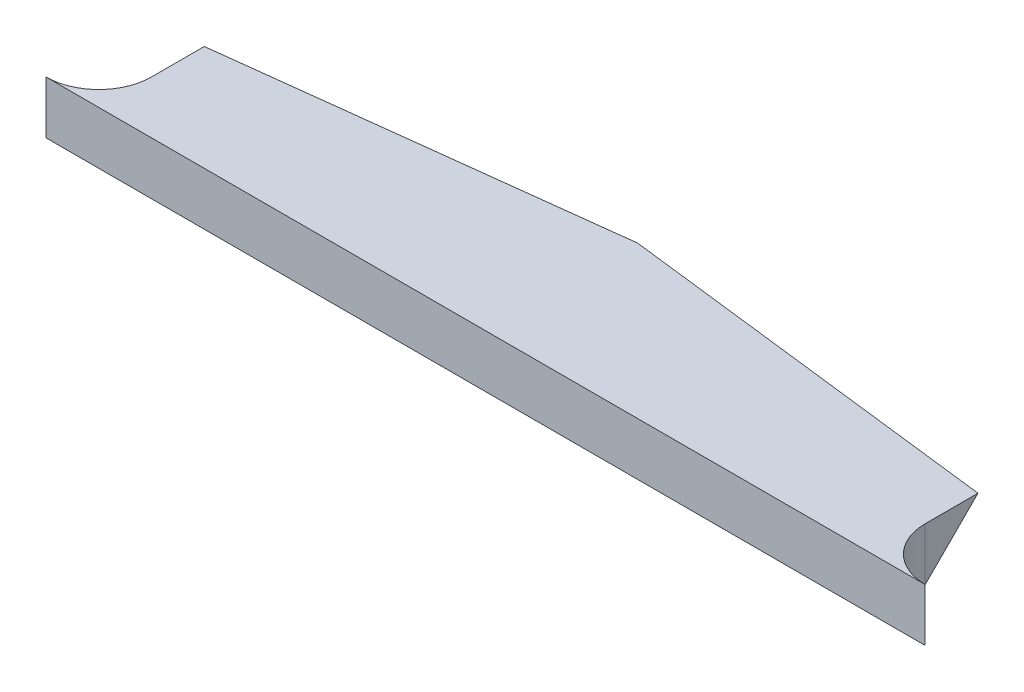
ISO-10303-21;
HEADER;
FILE_DESCRIPTION(('STEP AP214'),'2;1');
FILE_NAME('part.step','',(''),(''),'','','');
FILE_SCHEMA(('AUTOMOTIVE_DESIGN { 1 0 10303 214 1 1 1 1 }'));
ENDSEC;
DATA;
#1=APPLICATION_CONTEXT('core data for automotive mechanical design processes');
#2=APPLICATION_PROTOCOL_DEFINITION('international standard','automotive_design',2000,#1);
#3=PRODUCT_CONTEXT('',#1,'mechanical');
#4=PRODUCT('Part','Part','',(#3));
#5=PRODUCT_RELATED_PRODUCT_CATEGORY('part','',(#4));
#6=PRODUCT_DEFINITION_FORMATION('','',#4);
#7=PRODUCT_DEFINITION_CONTEXT('part definition',#1,'design');
#8=PRODUCT_DEFINITION('design','',#6,#7);
#9=PRODUCT_DEFINITION_SHAPE('','',#8);
#10=(LENGTH_UNIT() NAMED_UNIT(*) SI_UNIT(.MILLI.,.METRE.));
#11=(NAMED_UNIT(*) PLANE_ANGLE_UNIT() SI_UNIT($,.RADIAN.));
#12=(NAMED_UNIT(*) SI_UNIT($,.STERADIAN.) SOLID_ANGLE_UNIT());
#13=UNCERTAINTY_MEASURE_WITH_UNIT(LENGTH_MEASURE(1.E-05),#10,'distance_accuracy_value','');
#14=(GEOMETRIC_REPRESENTATION_CONTEXT(3) GLOBAL_UNCERTAINTY_ASSIGNED_CONTEXT((#13)) GLOBAL_UNIT_ASSIGNED_CONTEXT((#10,
#11,#12)) REPRESENTATION_CONTEXT('',''));
#15=CARTESIAN_POINT('',(0.,0.,0.));
#16=DIRECTION('',(0.,0.,1.));
#17=DIRECTION('',(1.,0.,0.));
#18=AXIS2_PLACEMENT_3D('',#15,#16,#17);
#19=CARTESIAN_POINT('',(50.0000000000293,19256.6480911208,193807.287108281));
#20=DIRECTION('',(0.,1.,0.));
#21=DIRECTION('',(0.,0.,1.));
#22=AXIS2_PLACEMENT_3D('',#19,#20,#21);
#23=PLANE('',#22);
#24=DIRECTION('',(0.,0.,-1.));
#25=VECTOR('',#24,1.);
#26=CARTESIAN_POINT('',(-43.9999999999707,19256.6480911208,193801.287108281));
#27=LINE('',#26,#25);
#28=CARTESIAN_POINT('',(-43.9999999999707,19256.6480911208,193801.287108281));
#29=VERTEX_POINT('',#28);
#30=CARTESIAN_POINT('',(-43.9999999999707,19256.6480911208,193795.287108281));
#31=VERTEX_POINT('',#30);
#32=EDGE_CURVE('E123',#29,#31,#27,.T.);
#33=ORIENTED_EDGE('',*,*,#32,.F.);
#34=CARTESIAN_POINT('',(-49.9999999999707,19256.6480911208,193801.287108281));
#35=DIRECTION('',(0.,1.,0.));
#36=DIRECTION('',(0.,0.,1.));
#37=AXIS2_PLACEMENT_3D('',#34,#35,#36);
#38=CIRCLE('',#37,6.);
#39=CARTESIAN_POINT('',(-49.9999999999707,19256.6480911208,193807.287108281));
#40=VERTEX_POINT('',#39);
#41=EDGE_CURVE('E148',#40,#29,#38,.T.);
#42=ORIENTED_EDGE('',*,*,#41,.F.);
#43=DIRECTION('',(1.,0.,0.));
#44=VECTOR('',#43,1.);
#45=CARTESIAN_POINT('',(50.0000000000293,19256.6480911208,193807.287108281));
#46=LINE('',#45,#44);
#47=CARTESIAN_POINT('',(50.0000000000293,19256.6480911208,193807.287108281));
#48=VERTEX_POINT('',#47);
#49=EDGE_CURVE('E11',#40,#48,#46,.T.);
#50=ORIENTED_EDGE('',*,*,#49,.T.);
#51=CARTESIAN_POINT('',(50.0000000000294,19256.6480911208,193801.287108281));
#52=DIRECTION('',(0.,1.,0.));
#53=DIRECTION('',(0.,0.,1.));
#54=AXIS2_PLACEMENT_3D('',#51,#52,#53);
#55=CIRCLE('',#54,6.);
#56=CARTESIAN_POINT('',(44.0000000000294,19256.6480911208,193801.287108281));
#57=VERTEX_POINT('',#56);
#58=EDGE_CURVE('E59',#57,#48,#55,.T.);
#59=ORIENTED_EDGE('',*,*,#58,.F.);
#60=DIRECTION('',(0.,0.,1.));
#61=VECTOR('',#60,1.);
#62=CARTESIAN_POINT('',(44.0000000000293,19256.6480911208,193795.287108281));
#63=LINE('',#62,#61);
#64=CARTESIAN_POINT('',(44.0000000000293,19256.6480911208,193795.287108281));
#65=VERTEX_POINT('',#64);
#66=EDGE_CURVE('E121',#65,#57,#63,.T.);
#67=ORIENTED_EDGE('',*,*,#66,.F.);
#68=DIRECTION('',(-0.992876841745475,0.,-0.119145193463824));
#69=VECTOR('',#68,1.);
#70=CARTESIAN_POINT('',(44.0000000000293,19256.6480911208,193795.287108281));
#71=LINE('',#70,#69);
#72=CARTESIAN_POINT('',(2.93572725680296E-11,19256.6480911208,193790.007109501));
#73=VERTEX_POINT('',#72);
#74=EDGE_CURVE('E100',#65,#73,#71,.T.);
#75=ORIENTED_EDGE('',*,*,#74,.T.);
#76=DIRECTION('',(-0.992876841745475,0.,0.119145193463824));
#77=VECTOR('',#76,1.);
#78=CARTESIAN_POINT('',(2.93580080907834E-11,19256.6480911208,193790.007109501));
#79=LINE('',#78,#77);
#80=EDGE_CURVE('E111',#73,#31,#79,.T.);
#81=ORIENTED_EDGE('',*,*,#80,.T.);
#82=EDGE_LOOP('',(#33,#42,#50,#59,#67,#75,#81));
#83=FACE_BOUND('',#82,.T.);
#84=ADVANCED_FACE('F44',(#83),#23,.T.);
#85=CARTESIAN_POINT('',(50.0000000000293,19250.6480911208,193807.287108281));
#86=DIRECTION('',(0.,-1.,0.));
#87=DIRECTION('',(0.,0.,-1.));
#88=AXIS2_PLACEMENT_3D('',#85,#86,#87);
#89=PLANE('',#88);
#90=DIRECTION('',(0.992876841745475,0.,-0.119145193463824));
#91=VECTOR('',#90,1.);
#92=CARTESIAN_POINT('',(-43.9999999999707,19250.6480911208,193801.287108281));
#93=LINE('',#92,#91);
#94=CARTESIAN_POINT('',(-43.9999999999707,19250.6480911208,193801.287108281));
#95=VERTEX_POINT('',#94);
#96=CARTESIAN_POINT('',(2.93572707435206E-11,19250.6480911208,193796.007109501));
#97=VERTEX_POINT('',#96);
#98=EDGE_CURVE('E108',#95,#97,#93,.T.);
#99=ORIENTED_EDGE('',*,*,#98,.T.);
#100=DIRECTION('',(0.992876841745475,0.,0.119145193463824));
#101=VECTOR('',#100,1.);
#102=CARTESIAN_POINT('',(2.93572725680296E-11,19250.6480911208,193796.007109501));
#103=LINE('',#102,#101);
#104=CARTESIAN_POINT('',(44.0000000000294,19250.6480911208,193801.287108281));
#105=VERTEX_POINT('',#104);
#106=EDGE_CURVE('E103',#97,#105,#103,.T.);
#107=ORIENTED_EDGE('',*,*,#106,.T.);
#108=CARTESIAN_POINT('',(50.0000000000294,19250.6480911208,193801.287108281));
#109=DIRECTION('',(0.,-1.,0.));
#110=DIRECTION('',(0.,0.,-1.));
#111=AXIS2_PLACEMENT_3D('',#108,#109,#110);
#112=CIRCLE('',#111,6.);
#113=CARTESIAN_POINT('',(50.0000000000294,19250.6480911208,193807.287108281));
#114=VERTEX_POINT('',#113);
#115=EDGE_CURVE('E143',#114,#105,#112,.T.);
#116=ORIENTED_EDGE('',*,*,#115,.F.);
#117=DIRECTION('',(-1.,0.,0.));
#118=VECTOR('',#117,1.);
#119=CARTESIAN_POINT('',(50.0000000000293,19250.6480911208,193807.287108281));
#120=LINE('',#119,#118);
#121=CARTESIAN_POINT('',(-49.9999999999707,19250.6480911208,193807.287108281));
#122=VERTEX_POINT('',#121);
#123=EDGE_CURVE('E152',#114,#122,#120,.T.);
#124=ORIENTED_EDGE('',*,*,#123,.T.);
#125=CARTESIAN_POINT('',(-49.9999999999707,19250.6480911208,193801.287108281));
#126=DIRECTION('',(0.,-1.,0.));
#127=DIRECTION('',(0.,0.,-1.));
#128=AXIS2_PLACEMENT_3D('',#125,#126,#127);
#129=CIRCLE('',#128,6.);
#130=EDGE_CURVE('E146',#95,#122,#129,.T.);
#131=ORIENTED_EDGE('',*,*,#130,.F.);
#132=EDGE_LOOP('',(#99,#107,#116,#124,#131));
#133=FACE_BOUND('',#132,.T.);
#134=ADVANCED_FACE('F46',(#133),#89,.T.);
#135=CARTESIAN_POINT('',(2.93430617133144E-11,19234.6480911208,193807.287108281));
#136=DIRECTION('',(0.,0.,-1.));
#137=DIRECTION('',(-1.,0.,0.));
#138=AXIS2_PLACEMENT_3D('',#135,#136,#137);
#139=PLANE('',#138);
#140=DIRECTION('',(0.,-1.,0.));
#141=VECTOR('',#140,1.);
#142=CARTESIAN_POINT('',(50.0000000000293,19256.6480911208,193807.287108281));
#143=LINE('',#142,#141);
#144=EDGE_CURVE('E150',#48,#114,#143,.T.);
#145=ORIENTED_EDGE('',*,*,#144,.F.);
#146=ORIENTED_EDGE('',*,*,#49,.F.);
#147=DIRECTION('',(0.,1.,0.));
#148=VECTOR('',#147,1.);
#149=CARTESIAN_POINT('',(-49.9999999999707,19256.6480911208,193807.287108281));
#150=LINE('',#149,#148);
#151=EDGE_CURVE('E52',#122,#40,#150,.T.);
#152=ORIENTED_EDGE('',*,*,#151,.F.);
#153=ORIENTED_EDGE('',*,*,#123,.F.);
#154=EDGE_LOOP('',(#145,#146,#152,#153));
#155=FACE_BOUND('',#154,.T.);
#156=ADVANCED_FACE('F159',(#155),#139,.F.);
#157=CARTESIAN_POINT('',(12.1822847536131,19336.1671542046,193709.026172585));
#158=DIRECTION('',(0.0845489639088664,0.704574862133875,0.704574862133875));
#159=DIRECTION('',(0.,-0.707106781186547,0.707106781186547));
#160=AXIS2_PLACEMENT_3D('',#157,#158,#159);
#161=PLANE('',#160);
#162=ORIENTED_EDGE('',*,*,#98,.F.);
#163=DIRECTION('',(0.,0.707106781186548,-0.707106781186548));
#164=VECTOR('',#163,1.);
#165=CARTESIAN_POINT('',(-43.9999999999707,19250.6480911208,193801.287108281));
#166=LINE('',#165,#164);
#167=EDGE_CURVE('E107',#95,#31,#166,.T.);
#168=ORIENTED_EDGE('',*,*,#167,.T.);
#169=ORIENTED_EDGE('',*,*,#80,.F.);
#170=DIRECTION('',(0.,-0.707106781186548,0.707106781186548));
#171=VECTOR('',#170,1.);
#172=CARTESIAN_POINT('',(2.93580080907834E-11,19256.6480911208,193790.007109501));
#173=LINE('',#172,#171);
#174=EDGE_CURVE('E95',#73,#97,#173,.T.);
#175=ORIENTED_EDGE('',*,*,#174,.T.);
#176=EDGE_LOOP('',(#162,#168,#169,#175));
#177=FACE_BOUND('',#176,.T.);
#178=ADVANCED_FACE('F112',(#177),#161,.F.);
#179=CARTESIAN_POINT('',(-43.9999999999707,19234.6480911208,193607.507109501));
#180=DIRECTION('',(1.,0.,0.));
#181=DIRECTION('',(0.,0.,-1.));
#182=AXIS2_PLACEMENT_3D('',#179,#180,#181);
#183=PLANE('',#182);
#184=ORIENTED_EDGE('',*,*,#167,.F.);
#185=DIRECTION('',(0.,-1.,0.));
#186=VECTOR('',#185,1.);
#187=CARTESIAN_POINT('',(-43.9999999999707,19256.6480911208,193801.287108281));
#188=LINE('',#187,#186);
#189=EDGE_CURVE('E132',#29,#95,#188,.T.);
#190=ORIENTED_EDGE('',*,*,#189,.F.);
#191=ORIENTED_EDGE('',*,*,#32,.T.);
#192=EDGE_LOOP('',(#184,#190,#191));
#193=FACE_BOUND('',#192,.T.);
#194=ADVANCED_FACE('F164',(#193),#183,.F.);
#195=CARTESIAN_POINT('',(-12.1822847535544,19336.1671542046,193709.026172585));
#196=DIRECTION('',(-0.0845489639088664,0.704574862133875,0.704574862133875));
#197=DIRECTION('',(0.,-0.707106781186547,0.707106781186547));
#198=AXIS2_PLACEMENT_3D('',#195,#196,#197);
#199=PLANE('',#198);
#200=ORIENTED_EDGE('',*,*,#174,.F.);
#201=ORIENTED_EDGE('',*,*,#74,.F.);
#202=DIRECTION('',(0.,-0.707106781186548,0.707106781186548));
#203=VECTOR('',#202,1.);
#204=CARTESIAN_POINT('',(44.0000000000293,19256.6480911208,193795.287108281));
#205=LINE('',#204,#203);
#206=EDGE_CURVE('E129',#65,#105,#205,.T.);
#207=ORIENTED_EDGE('',*,*,#206,.T.);
#208=ORIENTED_EDGE('',*,*,#106,.F.);
#209=EDGE_LOOP('',(#200,#201,#207,#208));
#210=FACE_BOUND('',#209,.T.);
#211=ADVANCED_FACE('F97',(#210),#199,.F.);
#212=CARTESIAN_POINT('',(44.0000000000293,19234.6480911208,193607.507109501));
#213=DIRECTION('',(1.,0.,0.));
#214=DIRECTION('',(0.,0.,-1.));
#215=AXIS2_PLACEMENT_3D('',#212,#213,#214);
#216=PLANE('',#215);
#217=ORIENTED_EDGE('',*,*,#66,.T.);
#218=DIRECTION('',(0.,1.,0.));
#219=VECTOR('',#218,1.);
#220=CARTESIAN_POINT('',(44.0000000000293,19250.6480911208,193801.287108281));
#221=LINE('',#220,#219);
#222=EDGE_CURVE('E332',#105,#57,#221,.T.);
#223=ORIENTED_EDGE('',*,*,#222,.F.);
#224=ORIENTED_EDGE('',*,*,#206,.F.);
#225=EDGE_LOOP('',(#217,#223,#224));
#226=FACE_BOUND('',#225,.T.);
#227=ADVANCED_FACE('F171',(#226),#216,.T.);
#228=CARTESIAN_POINT('',(-49.9999999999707,19248.5090911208,193801.287108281));
#229=DIRECTION('',(0.,1.,0.));
#230=DIRECTION('',(0.,0.,1.));
#231=AXIS2_PLACEMENT_3D('',#228,#229,#230);
#232=CYLINDRICAL_SURFACE('',#231,6.);
#233=ORIENTED_EDGE('',*,*,#41,.T.);
#234=ORIENTED_EDGE('',*,*,#189,.T.);
#235=ORIENTED_EDGE('',*,*,#130,.T.);
#236=ORIENTED_EDGE('',*,*,#151,.T.);
#237=EDGE_LOOP('',(#233,#234,#235,#236));
#238=FACE_BOUND('',#237,.T.);
#239=ADVANCED_FACE('F162',(#238),#232,.F.);
#240=CARTESIAN_POINT('',(50.0000000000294,19248.5090911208,193801.287108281));
#241=DIRECTION('',(0.,1.,0.));
#242=DIRECTION('',(0.,0.,1.));
#243=AXIS2_PLACEMENT_3D('',#240,#241,#242);
#244=CYLINDRICAL_SURFACE('',#243,6.);
#245=ORIENTED_EDGE('',*,*,#58,.T.);
#246=ORIENTED_EDGE('',*,*,#144,.T.);
#247=ORIENTED_EDGE('',*,*,#115,.T.);
#248=ORIENTED_EDGE('',*,*,#222,.T.);
#249=EDGE_LOOP('',(#245,#246,#247,#248));
#250=FACE_BOUND('',#249,.T.);
#251=ADVANCED_FACE('F188',(#250),#244,.F.);
#252=CLOSED_SHELL('',(#84,#134,#156,#178,#194,#211,#227,#239,#251));
#253=MANIFOLD_SOLID_BREP('B2',#252);
#254=ADVANCED_BREP_SHAPE_REPRESENTATION('',(#18,#253),#14);
#255=SHAPE_DEFINITION_REPRESENTATION(#9,#254);
ENDSEC;
END-ISO-10303-21;
